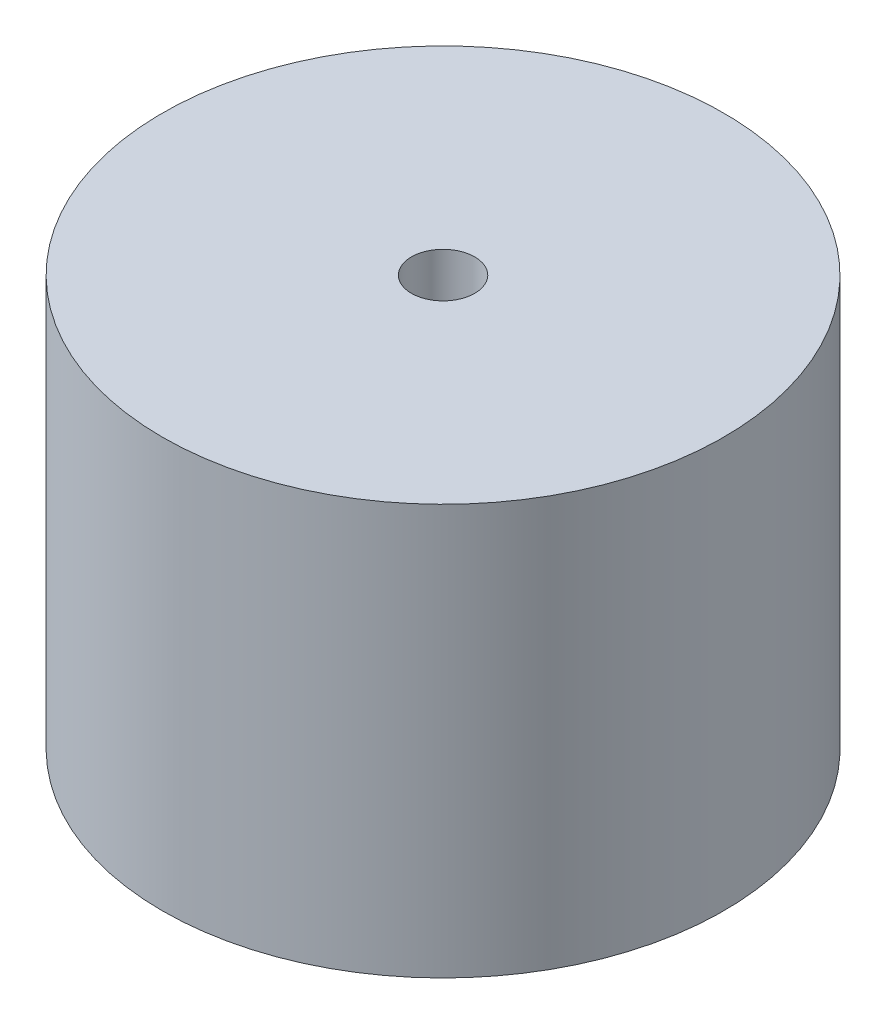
ISO-10303-21;
HEADER;
FILE_DESCRIPTION(('STEP AP214'),'2;1');
FILE_NAME('part.step','',(''),(''),'','','');
FILE_SCHEMA(('AUTOMOTIVE_DESIGN { 1 0 10303 214 1 1 1 1 }'));
ENDSEC;
DATA;
#1=APPLICATION_CONTEXT('core data for automotive mechanical design processes');
#2=APPLICATION_PROTOCOL_DEFINITION('international standard','automotive_design',2000,#1);
#3=PRODUCT_CONTEXT('',#1,'mechanical');
#4=PRODUCT('Part','Part','',(#3));
#5=PRODUCT_RELATED_PRODUCT_CATEGORY('part','',(#4));
#6=PRODUCT_DEFINITION_FORMATION('','',#4);
#7=PRODUCT_DEFINITION_CONTEXT('part definition',#1,'design');
#8=PRODUCT_DEFINITION('design','',#6,#7);
#9=PRODUCT_DEFINITION_SHAPE('','',#8);
#10=(LENGTH_UNIT() NAMED_UNIT(*) SI_UNIT(.MILLI.,.METRE.));
#11=(NAMED_UNIT(*) PLANE_ANGLE_UNIT() SI_UNIT($,.RADIAN.));
#12=(NAMED_UNIT(*) SI_UNIT($,.STERADIAN.) SOLID_ANGLE_UNIT());
#13=UNCERTAINTY_MEASURE_WITH_UNIT(LENGTH_MEASURE(1.E-05),#10,'distance_accuracy_value','');
#14=(GEOMETRIC_REPRESENTATION_CONTEXT(3) GLOBAL_UNCERTAINTY_ASSIGNED_CONTEXT((#13)) GLOBAL_UNIT_ASSIGNED_CONTEXT((#10,
#11,#12)) REPRESENTATION_CONTEXT('',''));
#15=CARTESIAN_POINT('',(0.,0.,0.));
#16=DIRECTION('',(0.,0.,1.));
#17=DIRECTION('',(1.,0.,0.));
#18=AXIS2_PLACEMENT_3D('',#15,#16,#17);
#19=CARTESIAN_POINT('',(0.,38.,0.));
#20=DIRECTION('',(0.,1.,0.));
#21=DIRECTION('',(0.,0.,1.));
#22=AXIS2_PLACEMENT_3D('',#19,#20,#21);
#23=PLANE('',#22);
#24=CARTESIAN_POINT('',(0.,38.,0.));
#25=DIRECTION('',(0.,1.,0.));
#26=DIRECTION('',(0.,0.,1.));
#27=AXIS2_PLACEMENT_3D('',#24,#25,#26);
#28=CIRCLE('',#27,26.);
#29=CARTESIAN_POINT('',(0.,38.,26.));
#30=VERTEX_POINT('',#29);
#31=EDGE_CURVE('E10',#30,#30,#28,.T.);
#32=ORIENTED_EDGE('',*,*,#31,.T.);
#33=EDGE_LOOP('',(#32));
#34=FACE_BOUND('',#33,.T.);
#35=CARTESIAN_POINT('',(0.,38.,0.));
#36=DIRECTION('',(0.,1.,0.));
#37=DIRECTION('',(0.,0.,1.));
#38=AXIS2_PLACEMENT_3D('',#35,#36,#37);
#39=CIRCLE('',#38,2.92974682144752);
#40=CARTESIAN_POINT('',(0.,38.,2.92974682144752));
#41=VERTEX_POINT('',#40);
#42=EDGE_CURVE('E42',#41,#41,#39,.T.);
#43=ORIENTED_EDGE('',*,*,#42,.F.);
#44=EDGE_LOOP('',(#43));
#45=FACE_BOUND('',#44,.T.);
#46=ADVANCED_FACE('F31',(#34,#45),#23,.T.);
#47=CARTESIAN_POINT('',(0.,0.,0.));
#48=DIRECTION('',(0.,1.,0.));
#49=DIRECTION('',(0.,0.,1.));
#50=AXIS2_PLACEMENT_3D('',#47,#48,#49);
#51=PLANE('',#50);
#52=CARTESIAN_POINT('',(0.,0.,0.));
#53=DIRECTION('',(0.,1.,0.));
#54=DIRECTION('',(0.,0.,1.));
#55=AXIS2_PLACEMENT_3D('',#52,#53,#54);
#56=CIRCLE('',#55,26.);
#57=CARTESIAN_POINT('',(0.,0.,26.));
#58=VERTEX_POINT('',#57);
#59=EDGE_CURVE('E35',#58,#58,#56,.T.);
#60=ORIENTED_EDGE('',*,*,#59,.F.);
#61=EDGE_LOOP('',(#60));
#62=FACE_BOUND('',#61,.T.);
#63=CARTESIAN_POINT('',(0.,0.,0.));
#64=DIRECTION('',(0.,1.,0.));
#65=DIRECTION('',(0.,0.,1.));
#66=AXIS2_PLACEMENT_3D('',#63,#64,#65);
#67=CIRCLE('',#66,2.92974682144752);
#68=CARTESIAN_POINT('',(0.,0.,2.92974682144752));
#69=VERTEX_POINT('',#68);
#70=EDGE_CURVE('E44',#69,#69,#67,.T.);
#71=ORIENTED_EDGE('',*,*,#70,.T.);
#72=EDGE_LOOP('',(#71));
#73=FACE_BOUND('',#72,.T.);
#74=ADVANCED_FACE('F54',(#62,#73),#51,.F.);
#75=CARTESIAN_POINT('',(0.,38.,0.));
#76=DIRECTION('',(0.,-1.,0.));
#77=DIRECTION('',(0.,0.,-1.));
#78=AXIS2_PLACEMENT_3D('',#75,#76,#77);
#79=CYLINDRICAL_SURFACE('',#78,26.);
#80=ORIENTED_EDGE('',*,*,#31,.F.);
#81=EDGE_LOOP('',(#80));
#82=FACE_BOUND('',#81,.T.);
#83=ORIENTED_EDGE('',*,*,#59,.T.);
#84=EDGE_LOOP('',(#83));
#85=FACE_BOUND('',#84,.T.);
#86=ADVANCED_FACE('F33',(#82,#85),#79,.T.);
#87=CARTESIAN_POINT('',(0.,38.,0.));
#88=DIRECTION('',(0.,-1.,0.));
#89=DIRECTION('',(0.,0.,-1.));
#90=AXIS2_PLACEMENT_3D('',#87,#88,#89);
#91=CYLINDRICAL_SURFACE('',#90,2.92974682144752);
#92=ORIENTED_EDGE('',*,*,#42,.T.);
#93=EDGE_LOOP('',(#92));
#94=FACE_BOUND('',#93,.T.);
#95=ORIENTED_EDGE('',*,*,#70,.F.);
#96=EDGE_LOOP('',(#95));
#97=FACE_BOUND('',#96,.T.);
#98=ADVANCED_FACE('F50',(#94,#97),#91,.F.);
#99=CLOSED_SHELL('',(#46,#74,#86,#98));
#100=MANIFOLD_SOLID_BREP('B2',#99);
#101=ADVANCED_BREP_SHAPE_REPRESENTATION('',(#18,#100),#14);
#102=SHAPE_DEFINITION_REPRESENTATION(#9,#101);
ENDSEC;
END-ISO-10303-21;
